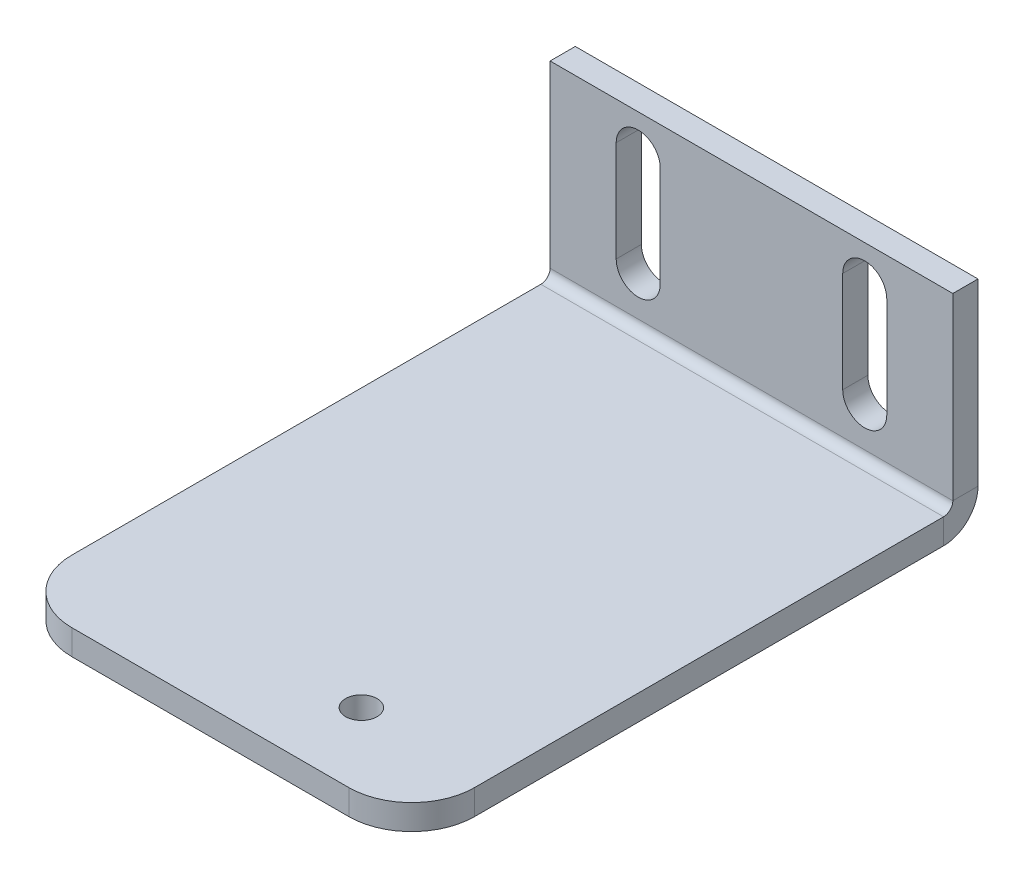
ISO-10303-21;
HEADER;
FILE_DESCRIPTION(('STEP AP214'),'2;1');
FILE_NAME('part.step','',(''),(''),'','','');
FILE_SCHEMA(('AUTOMOTIVE_DESIGN { 1 0 10303 214 1 1 1 1 }'));
ENDSEC;
DATA;
#1=APPLICATION_CONTEXT('core data for automotive mechanical design processes');
#2=APPLICATION_PROTOCOL_DEFINITION('international standard','automotive_design',2000,#1);
#3=PRODUCT_CONTEXT('',#1,'mechanical');
#4=PRODUCT('Part','Part','',(#3));
#5=PRODUCT_RELATED_PRODUCT_CATEGORY('part','',(#4));
#6=PRODUCT_DEFINITION_FORMATION('','',#4);
#7=PRODUCT_DEFINITION_CONTEXT('part definition',#1,'design');
#8=PRODUCT_DEFINITION('design','',#6,#7);
#9=PRODUCT_DEFINITION_SHAPE('','',#8);
#10=(LENGTH_UNIT() NAMED_UNIT(*) SI_UNIT(.MILLI.,.METRE.));
#11=(NAMED_UNIT(*) PLANE_ANGLE_UNIT() SI_UNIT($,.RADIAN.));
#12=(NAMED_UNIT(*) SI_UNIT($,.STERADIAN.) SOLID_ANGLE_UNIT());
#13=UNCERTAINTY_MEASURE_WITH_UNIT(LENGTH_MEASURE(1.E-05),#10,'distance_accuracy_value','');
#14=(GEOMETRIC_REPRESENTATION_CONTEXT(3) GLOBAL_UNCERTAINTY_ASSIGNED_CONTEXT((#13)) GLOBAL_UNIT_ASSIGNED_CONTEXT((#10,
#11,#12)) REPRESENTATION_CONTEXT('',''));
#15=CARTESIAN_POINT('',(0.,0.,0.));
#16=DIRECTION('',(0.,0.,1.));
#17=DIRECTION('',(1.,0.,0.));
#18=AXIS2_PLACEMENT_3D('',#15,#16,#17);
#19=CARTESIAN_POINT('',(444.015455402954,32.092185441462,-2.));
#20=DIRECTION('',(1.,0.,0.));
#21=DIRECTION('',(0.,0.,-1.));
#22=AXIS2_PLACEMENT_3D('',#19,#20,#21);
#23=PLANE('',#22);
#24=DIRECTION('',(0.,1.,0.));
#25=VECTOR('',#24,1.);
#26=CARTESIAN_POINT('',(444.015455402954,32.092185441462,0.));
#27=LINE('',#26,#25);
#28=CARTESIAN_POINT('',(444.015455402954,34.828785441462,0.));
#29=VERTEX_POINT('',#28);
#30=CARTESIAN_POINT('',(444.015455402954,49.092185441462,0.));
#31=VERTEX_POINT('',#30);
#32=EDGE_CURVE('E265',#29,#31,#27,.T.);
#33=ORIENTED_EDGE('',*,*,#32,.F.);
#34=DIRECTION('',(0.,0.,-1.));
#35=VECTOR('',#34,1.);
#36=CARTESIAN_POINT('',(444.015455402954,34.828785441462,0.));
#37=LINE('',#36,#35);
#38=CARTESIAN_POINT('',(444.015455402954,34.828785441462,-2.));
#39=VERTEX_POINT('',#38);
#40=EDGE_CURVE('E251',#29,#39,#37,.T.);
#41=ORIENTED_EDGE('',*,*,#40,.T.);
#42=DIRECTION('',(0.,1.,0.));
#43=VECTOR('',#42,1.);
#44=CARTESIAN_POINT('',(444.015455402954,32.092185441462,-2.));
#45=LINE('',#44,#43);
#46=CARTESIAN_POINT('',(444.015455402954,49.092185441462,-2.));
#47=VERTEX_POINT('',#46);
#48=EDGE_CURVE('E268',#39,#47,#45,.T.);
#49=ORIENTED_EDGE('',*,*,#48,.T.);
#50=DIRECTION('',(0.,0.,1.));
#51=VECTOR('',#50,1.);
#52=CARTESIAN_POINT('',(444.015455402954,49.092185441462,-2.));
#53=LINE('',#52,#51);
#54=EDGE_CURVE('E277',#47,#31,#53,.T.);
#55=ORIENTED_EDGE('',*,*,#54,.T.);
#56=EDGE_LOOP('',(#33,#41,#49,#55));
#57=FACE_BOUND('',#56,.T.);
#58=ADVANCED_FACE('F16',(#57),#23,.T.);
#59=CARTESIAN_POINT('',(0.,0.,-2.));
#60=DIRECTION('',(0.,0.,1.));
#61=DIRECTION('',(1.,0.,0.));
#62=AXIS2_PLACEMENT_3D('',#59,#60,#61);
#63=PLANE('',#62);
#64=DIRECTION('',(0.,1.,0.));
#65=VECTOR('',#64,1.);
#66=CARTESIAN_POINT('',(438.765455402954,46.092185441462,-2.));
#67=LINE('',#66,#65);
#68=CARTESIAN_POINT('',(438.765455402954,38.092185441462,-2.));
#69=VERTEX_POINT('',#68);
#70=CARTESIAN_POINT('',(438.765455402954,46.092185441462,-2.));
#71=VERTEX_POINT('',#70);
#72=EDGE_CURVE('E155',#69,#71,#67,.T.);
#73=ORIENTED_EDGE('',*,*,#72,.T.);
#74=CARTESIAN_POINT('',(437.015455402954,46.092185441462,-2.));
#75=DIRECTION('',(0.,0.,1.));
#76=DIRECTION('',(-1.,0.,0.));
#77=AXIS2_PLACEMENT_3D('',#74,#75,#76);
#78=CIRCLE('',#77,1.74999999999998);
#79=CARTESIAN_POINT('',(435.265455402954,46.092185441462,-2.));
#80=VERTEX_POINT('',#79);
#81=EDGE_CURVE('E147',#71,#80,#78,.T.);
#82=ORIENTED_EDGE('',*,*,#81,.T.);
#83=DIRECTION('',(0.,-1.,0.));
#84=VECTOR('',#83,1.);
#85=CARTESIAN_POINT('',(435.265455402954,46.092185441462,-2.));
#86=LINE('',#85,#84);
#87=CARTESIAN_POINT('',(435.265455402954,38.092185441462,-2.));
#88=VERTEX_POINT('',#87);
#89=EDGE_CURVE('E159',#80,#88,#86,.T.);
#90=ORIENTED_EDGE('',*,*,#89,.T.);
#91=CARTESIAN_POINT('',(437.015455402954,38.092185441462,-2.));
#92=DIRECTION('',(0.,0.,1.));
#93=DIRECTION('',(-1.,0.,0.));
#94=AXIS2_PLACEMENT_3D('',#91,#92,#93);
#95=CIRCLE('',#94,1.74999999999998);
#96=EDGE_CURVE('E163',#88,#69,#95,.T.);
#97=ORIENTED_EDGE('',*,*,#96,.T.);
#98=EDGE_LOOP('',(#73,#82,#90,#97));
#99=FACE_BOUND('',#98,.T.);
#100=DIRECTION('',(0.,1.,0.));
#101=VECTOR('',#100,1.);
#102=CARTESIAN_POINT('',(420.765455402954,46.092185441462,-2.));
#103=LINE('',#102,#101);
#104=CARTESIAN_POINT('',(420.765455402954,38.092185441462,-2.));
#105=VERTEX_POINT('',#104);
#106=CARTESIAN_POINT('',(420.765455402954,46.092185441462,-2.));
#107=VERTEX_POINT('',#106);
#108=EDGE_CURVE('E200',#105,#107,#103,.T.);
#109=ORIENTED_EDGE('',*,*,#108,.T.);
#110=CARTESIAN_POINT('',(419.015455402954,46.092185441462,-2.));
#111=DIRECTION('',(0.,0.,1.));
#112=DIRECTION('',(1.,0.,0.));
#113=AXIS2_PLACEMENT_3D('',#110,#111,#112);
#114=CIRCLE('',#113,1.74999999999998);
#115=CARTESIAN_POINT('',(417.265455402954,46.092185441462,-2.));
#116=VERTEX_POINT('',#115);
#117=EDGE_CURVE('E190',#107,#116,#114,.T.);
#118=ORIENTED_EDGE('',*,*,#117,.T.);
#119=DIRECTION('',(0.,-1.,0.));
#120=VECTOR('',#119,1.);
#121=CARTESIAN_POINT('',(417.265455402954,46.092185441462,-2.));
#122=LINE('',#121,#120);
#123=CARTESIAN_POINT('',(417.265455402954,38.092185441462,-2.));
#124=VERTEX_POINT('',#123);
#125=EDGE_CURVE('E193',#116,#124,#122,.T.);
#126=ORIENTED_EDGE('',*,*,#125,.T.);
#127=CARTESIAN_POINT('',(419.015455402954,38.092185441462,-2.));
#128=DIRECTION('',(0.,0.,1.));
#129=DIRECTION('',(1.,0.,0.));
#130=AXIS2_PLACEMENT_3D('',#127,#128,#129);
#131=CIRCLE('',#130,1.74999999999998);
#132=EDGE_CURVE('E197',#124,#105,#131,.T.);
#133=ORIENTED_EDGE('',*,*,#132,.T.);
#134=EDGE_LOOP('',(#109,#118,#126,#133));
#135=FACE_BOUND('',#134,.T.);
#136=DIRECTION('',(1.,0.,0.));
#137=VECTOR('',#136,1.);
#138=CARTESIAN_POINT('',(444.015455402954,34.828785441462,-2.));
#139=LINE('',#138,#137);
#140=CARTESIAN_POINT('',(412.015455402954,34.828785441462,-2.));
#141=VERTEX_POINT('',#140);
#142=EDGE_CURVE('E245',#39,#141,#139,.F.);
#143=ORIENTED_EDGE('',*,*,#142,.T.);
#144=DIRECTION('',(0.,-1.,0.));
#145=VECTOR('',#144,1.);
#146=CARTESIAN_POINT('',(412.015455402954,32.092185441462,-2.));
#147=LINE('',#146,#145);
#148=CARTESIAN_POINT('',(412.015455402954,49.092185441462,-2.));
#149=VERTEX_POINT('',#148);
#150=EDGE_CURVE('E274',#149,#141,#147,.T.);
#151=ORIENTED_EDGE('',*,*,#150,.F.);
#152=DIRECTION('',(-1.,0.,0.));
#153=VECTOR('',#152,1.);
#154=CARTESIAN_POINT('',(444.015455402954,49.092185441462,-2.));
#155=LINE('',#154,#153);
#156=EDGE_CURVE('E270',#47,#149,#155,.T.);
#157=ORIENTED_EDGE('',*,*,#156,.F.);
#158=ORIENTED_EDGE('',*,*,#48,.F.);
#159=EDGE_LOOP('',(#143,#151,#157,#158));
#160=FACE_BOUND('',#159,.T.);
#161=ADVANCED_FACE('F165',(#99,#135,#160),#63,.F.);
#162=CARTESIAN_POINT('',(0.,0.,0.));
#163=DIRECTION('',(0.,0.,1.));
#164=DIRECTION('',(1.,0.,0.));
#165=AXIS2_PLACEMENT_3D('',#162,#163,#164);
#166=PLANE('',#165);
#167=CARTESIAN_POINT('',(437.015455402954,46.092185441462,0.));
#168=DIRECTION('',(0.,0.,1.));
#169=DIRECTION('',(-1.,0.,0.));
#170=AXIS2_PLACEMENT_3D('',#167,#168,#169);
#171=CIRCLE('',#170,1.74999999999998);
#172=CARTESIAN_POINT('',(438.765455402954,46.092185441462,0.));
#173=VERTEX_POINT('',#172);
#174=CARTESIAN_POINT('',(435.265455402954,46.092185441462,0.));
#175=VERTEX_POINT('',#174);
#176=EDGE_CURVE('E150',#173,#175,#171,.T.);
#177=ORIENTED_EDGE('',*,*,#176,.F.);
#178=DIRECTION('',(0.,1.,0.));
#179=VECTOR('',#178,1.);
#180=CARTESIAN_POINT('',(438.765455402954,46.092185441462,0.));
#181=LINE('',#180,#179);
#182=CARTESIAN_POINT('',(438.765455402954,38.092185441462,0.));
#183=VERTEX_POINT('',#182);
#184=EDGE_CURVE('E168',#183,#173,#181,.T.);
#185=ORIENTED_EDGE('',*,*,#184,.F.);
#186=CARTESIAN_POINT('',(437.015455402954,38.092185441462,0.));
#187=DIRECTION('',(0.,0.,1.));
#188=DIRECTION('',(-1.,0.,0.));
#189=AXIS2_PLACEMENT_3D('',#186,#187,#188);
#190=CIRCLE('',#189,1.74999999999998);
#191=CARTESIAN_POINT('',(435.265455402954,38.092185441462,0.));
#192=VERTEX_POINT('',#191);
#193=EDGE_CURVE('E171',#192,#183,#190,.T.);
#194=ORIENTED_EDGE('',*,*,#193,.F.);
#195=DIRECTION('',(0.,-1.,0.));
#196=VECTOR('',#195,1.);
#197=CARTESIAN_POINT('',(435.265455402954,46.092185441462,0.));
#198=LINE('',#197,#196);
#199=EDGE_CURVE('E180',#175,#192,#198,.T.);
#200=ORIENTED_EDGE('',*,*,#199,.F.);
#201=EDGE_LOOP('',(#177,#185,#194,#200));
#202=FACE_BOUND('',#201,.T.);
#203=CARTESIAN_POINT('',(419.015455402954,46.092185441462,0.));
#204=DIRECTION('',(0.,0.,1.));
#205=DIRECTION('',(1.,0.,0.));
#206=AXIS2_PLACEMENT_3D('',#203,#204,#205);
#207=CIRCLE('',#206,1.74999999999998);
#208=CARTESIAN_POINT('',(420.765455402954,46.092185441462,0.));
#209=VERTEX_POINT('',#208);
#210=CARTESIAN_POINT('',(417.265455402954,46.092185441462,0.));
#211=VERTEX_POINT('',#210);
#212=EDGE_CURVE('E186',#209,#211,#207,.T.);
#213=ORIENTED_EDGE('',*,*,#212,.F.);
#214=DIRECTION('',(0.,1.,0.));
#215=VECTOR('',#214,1.);
#216=CARTESIAN_POINT('',(420.765455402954,46.092185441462,0.));
#217=LINE('',#216,#215);
#218=CARTESIAN_POINT('',(420.765455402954,38.092185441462,0.));
#219=VERTEX_POINT('',#218);
#220=EDGE_CURVE('E194',#219,#209,#217,.T.);
#221=ORIENTED_EDGE('',*,*,#220,.F.);
#222=CARTESIAN_POINT('',(419.015455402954,38.092185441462,0.));
#223=DIRECTION('',(0.,0.,1.));
#224=DIRECTION('',(1.,0.,0.));
#225=AXIS2_PLACEMENT_3D('',#222,#223,#224);
#226=CIRCLE('',#225,1.74999999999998);
#227=CARTESIAN_POINT('',(417.265455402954,38.092185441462,0.));
#228=VERTEX_POINT('',#227);
#229=EDGE_CURVE('E208',#228,#219,#226,.T.);
#230=ORIENTED_EDGE('',*,*,#229,.F.);
#231=DIRECTION('',(0.,-1.,0.));
#232=VECTOR('',#231,1.);
#233=CARTESIAN_POINT('',(417.265455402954,46.092185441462,0.));
#234=LINE('',#233,#232);
#235=EDGE_CURVE('E205',#211,#228,#234,.T.);
#236=ORIENTED_EDGE('',*,*,#235,.F.);
#237=EDGE_LOOP('',(#213,#221,#230,#236));
#238=FACE_BOUND('',#237,.T.);
#239=DIRECTION('',(0.,-1.,0.));
#240=VECTOR('',#239,1.);
#241=CARTESIAN_POINT('',(412.015455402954,32.092185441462,0.));
#242=LINE('',#241,#240);
#243=CARTESIAN_POINT('',(412.015455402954,49.092185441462,0.));
#244=VERTEX_POINT('',#243);
#245=CARTESIAN_POINT('',(412.015455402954,34.828785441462,0.));
#246=VERTEX_POINT('',#245);
#247=EDGE_CURVE('E271',#244,#246,#242,.T.);
#248=ORIENTED_EDGE('',*,*,#247,.T.);
#249=DIRECTION('',(1.,0.,0.));
#250=VECTOR('',#249,1.);
#251=CARTESIAN_POINT('',(444.015455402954,34.828785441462,0.));
#252=LINE('',#251,#250);
#253=EDGE_CURVE('E257',#29,#246,#252,.F.);
#254=ORIENTED_EDGE('',*,*,#253,.F.);
#255=ORIENTED_EDGE('',*,*,#32,.T.);
#256=DIRECTION('',(-1.,0.,0.));
#257=VECTOR('',#256,1.);
#258=CARTESIAN_POINT('',(444.015455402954,49.092185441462,0.));
#259=LINE('',#258,#257);
#260=EDGE_CURVE('E279',#31,#244,#259,.T.);
#261=ORIENTED_EDGE('',*,*,#260,.T.);
#262=EDGE_LOOP('',(#248,#254,#255,#261));
#263=FACE_BOUND('',#262,.T.);
#264=ADVANCED_FACE('F339',(#202,#238,#263),#166,.T.);
#265=CARTESIAN_POINT('',(412.015455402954,32.092185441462,-2.));
#266=DIRECTION('',(-1.,0.,0.));
#267=DIRECTION('',(0.,0.,1.));
#268=AXIS2_PLACEMENT_3D('',#265,#266,#267);
#269=PLANE('',#268);
#270=DIRECTION('',(0.,0.,-1.));
#271=VECTOR('',#270,1.);
#272=CARTESIAN_POINT('',(412.015455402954,34.828785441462,0.));
#273=LINE('',#272,#271);
#274=EDGE_CURVE('E262',#246,#141,#273,.T.);
#275=ORIENTED_EDGE('',*,*,#274,.F.);
#276=ORIENTED_EDGE('',*,*,#247,.F.);
#277=DIRECTION('',(0.,0.,1.));
#278=VECTOR('',#277,1.);
#279=CARTESIAN_POINT('',(412.015455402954,49.092185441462,-2.));
#280=LINE('',#279,#278);
#281=EDGE_CURVE('E284',#149,#244,#280,.T.);
#282=ORIENTED_EDGE('',*,*,#281,.F.);
#283=ORIENTED_EDGE('',*,*,#150,.T.);
#284=EDGE_LOOP('',(#275,#276,#282,#283));
#285=FACE_BOUND('',#284,.T.);
#286=ADVANCED_FACE('F336',(#285),#269,.T.);
#287=CARTESIAN_POINT('',(444.015455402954,49.092185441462,-2.));
#288=DIRECTION('',(0.,1.,0.));
#289=DIRECTION('',(0.,0.,1.));
#290=AXIS2_PLACEMENT_3D('',#287,#288,#289);
#291=PLANE('',#290);
#292=ORIENTED_EDGE('',*,*,#260,.F.);
#293=ORIENTED_EDGE('',*,*,#54,.F.);
#294=ORIENTED_EDGE('',*,*,#156,.T.);
#295=ORIENTED_EDGE('',*,*,#281,.T.);
#296=EDGE_LOOP('',(#292,#293,#294,#295));
#297=FACE_BOUND('',#296,.T.);
#298=ADVANCED_FACE('F364',(#297),#291,.T.);
#299=CARTESIAN_POINT('',(412.015455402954,34.828785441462,0.7366));
#300=DIRECTION('',(-1.,0.,0.));
#301=DIRECTION('',(0.,0.,1.));
#302=AXIS2_PLACEMENT_3D('',#299,#300,#301);
#303=PLANE('',#302);
#304=DIRECTION('',(0.,1.,0.));
#305=VECTOR('',#304,1.);
#306=CARTESIAN_POINT('',(412.015455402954,32.092185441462,0.73659999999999));
#307=LINE('',#306,#305);
#308=CARTESIAN_POINT('',(412.015455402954,34.092185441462,0.7366));
#309=VERTEX_POINT('',#308);
#310=CARTESIAN_POINT('',(412.015455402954,32.092185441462,0.73659999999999));
#311=VERTEX_POINT('',#310);
#312=EDGE_CURVE('E215',#309,#311,#307,.F.);
#313=ORIENTED_EDGE('',*,*,#312,.F.);
#314=CARTESIAN_POINT('',(412.015455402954,34.828785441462,0.7366));
#315=DIRECTION('',(1.,0.,0.));
#316=DIRECTION('',(0.,0.,-1.));
#317=AXIS2_PLACEMENT_3D('',#314,#315,#316);
#318=CIRCLE('',#317,0.7366);
#319=EDGE_CURVE('E254',#246,#309,#318,.F.);
#320=ORIENTED_EDGE('',*,*,#319,.F.);
#321=ORIENTED_EDGE('',*,*,#274,.T.);
#322=CARTESIAN_POINT('',(412.015455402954,34.828785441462,0.7366));
#323=DIRECTION('',(1.,0.,0.));
#324=DIRECTION('',(0.,0.,-1.));
#325=AXIS2_PLACEMENT_3D('',#322,#323,#324);
#326=CIRCLE('',#325,2.7366);
#327=EDGE_CURVE('E247',#141,#311,#326,.F.);
#328=ORIENTED_EDGE('',*,*,#327,.T.);
#329=EDGE_LOOP('',(#313,#320,#321,#328));
#330=FACE_BOUND('',#329,.T.);
#331=ADVANCED_FACE('F332',(#330),#303,.T.);
#332=CARTESIAN_POINT('',(444.015455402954,34.828785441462,0.7366));
#333=DIRECTION('',(-1.,0.,0.));
#334=DIRECTION('',(0.,0.,1.));
#335=AXIS2_PLACEMENT_3D('',#332,#333,#334);
#336=PLANE('',#335);
#337=CARTESIAN_POINT('',(444.015455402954,34.828785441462,0.7366));
#338=DIRECTION('',(1.,0.,0.));
#339=DIRECTION('',(0.,0.,-1.));
#340=AXIS2_PLACEMENT_3D('',#337,#338,#339);
#341=CIRCLE('',#340,0.7366);
#342=CARTESIAN_POINT('',(444.015455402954,34.092185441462,0.7366));
#343=VERTEX_POINT('',#342);
#344=EDGE_CURVE('E224',#343,#29,#341,.T.);
#345=ORIENTED_EDGE('',*,*,#344,.F.);
#346=DIRECTION('',(0.,1.,0.));
#347=VECTOR('',#346,1.);
#348=CARTESIAN_POINT('',(444.015455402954,34.092185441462,0.7366));
#349=LINE('',#348,#347);
#350=CARTESIAN_POINT('',(444.015455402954,32.092185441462,0.73659999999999));
#351=VERTEX_POINT('',#350);
#352=EDGE_CURVE('E238',#343,#351,#349,.F.);
#353=ORIENTED_EDGE('',*,*,#352,.T.);
#354=CARTESIAN_POINT('',(444.015455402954,34.828785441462,0.7366));
#355=DIRECTION('',(1.,0.,0.));
#356=DIRECTION('',(0.,0.,-1.));
#357=AXIS2_PLACEMENT_3D('',#354,#355,#356);
#358=CIRCLE('',#357,2.7366);
#359=EDGE_CURVE('E248',#351,#39,#358,.T.);
#360=ORIENTED_EDGE('',*,*,#359,.T.);
#361=ORIENTED_EDGE('',*,*,#40,.F.);
#362=EDGE_LOOP('',(#345,#353,#360,#361));
#363=FACE_BOUND('',#362,.T.);
#364=ADVANCED_FACE('F325',(#363),#336,.F.);
#365=CARTESIAN_POINT('',(444.015455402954,34.828785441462,0.7366));
#366=DIRECTION('',(1.,0.,0.));
#367=DIRECTION('',(0.,-1.,0.));
#368=AXIS2_PLACEMENT_3D('',#365,#366,#367);
#369=CYLINDRICAL_SURFACE('',#368,2.7366);
#370=ORIENTED_EDGE('',*,*,#142,.F.);
#371=ORIENTED_EDGE('',*,*,#359,.F.);
#372=DIRECTION('',(1.,0.,0.));
#373=VECTOR('',#372,1.);
#374=CARTESIAN_POINT('',(412.015455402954,32.092185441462,0.73659999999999));
#375=LINE('',#374,#373);
#376=EDGE_CURVE('E235',#351,#311,#375,.F.);
#377=ORIENTED_EDGE('',*,*,#376,.T.);
#378=ORIENTED_EDGE('',*,*,#327,.F.);
#379=EDGE_LOOP('',(#370,#371,#377,#378));
#380=FACE_BOUND('',#379,.T.);
#381=ADVANCED_FACE('F330',(#380),#369,.T.);
#382=CARTESIAN_POINT('',(444.015455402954,34.828785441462,0.7366));
#383=DIRECTION('',(1.,0.,0.));
#384=DIRECTION('',(0.,-1.,0.));
#385=AXIS2_PLACEMENT_3D('',#382,#383,#384);
#386=CYLINDRICAL_SURFACE('',#385,0.7366);
#387=ORIENTED_EDGE('',*,*,#253,.T.);
#388=ORIENTED_EDGE('',*,*,#319,.T.);
#389=DIRECTION('',(1.,0.,0.));
#390=VECTOR('',#389,1.);
#391=CARTESIAN_POINT('',(412.015455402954,34.092185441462,0.7366));
#392=LINE('',#391,#390);
#393=EDGE_CURVE('E241',#309,#343,#392,.T.);
#394=ORIENTED_EDGE('',*,*,#393,.T.);
#395=ORIENTED_EDGE('',*,*,#344,.T.);
#396=EDGE_LOOP('',(#387,#388,#394,#395));
#397=FACE_BOUND('',#396,.T.);
#398=ADVANCED_FACE('F343',(#397),#386,.F.);
#399=CARTESIAN_POINT('',(412.015455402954,32.092185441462,0.));
#400=DIRECTION('',(1.,0.,0.));
#401=DIRECTION('',(0.,1.,0.));
#402=AXIS2_PLACEMENT_3D('',#399,#400,#401);
#403=PLANE('',#402);
#404=DIRECTION('',(0.,0.,-1.));
#405=VECTOR('',#404,1.);
#406=CARTESIAN_POINT('',(412.015455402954,32.092185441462,1.06948524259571E-13));
#407=LINE('',#406,#405);
#408=CARTESIAN_POINT('',(412.015455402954,32.0921854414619,38.));
#409=VERTEX_POINT('',#408);
#410=EDGE_CURVE('E227',#409,#311,#407,.T.);
#411=ORIENTED_EDGE('',*,*,#410,.F.);
#412=DIRECTION('',(0.,1.,0.));
#413=VECTOR('',#412,1.);
#414=CARTESIAN_POINT('',(412.015455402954,32.0921854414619,38.));
#415=LINE('',#414,#413);
#416=CARTESIAN_POINT('',(412.015455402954,34.0921854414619,38.));
#417=VERTEX_POINT('',#416);
#418=EDGE_CURVE('E286',#409,#417,#415,.T.);
#419=ORIENTED_EDGE('',*,*,#418,.T.);
#420=DIRECTION('',(0.,0.,1.));
#421=VECTOR('',#420,1.);
#422=CARTESIAN_POINT('',(412.015455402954,34.092185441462,0.));
#423=LINE('',#422,#421);
#424=EDGE_CURVE('E233',#417,#309,#423,.F.);
#425=ORIENTED_EDGE('',*,*,#424,.T.);
#426=ORIENTED_EDGE('',*,*,#312,.T.);
#427=EDGE_LOOP('',(#411,#419,#425,#426));
#428=FACE_BOUND('',#427,.T.);
#429=ADVANCED_FACE('F308',(#428),#403,.F.);
#430=CARTESIAN_POINT('',(444.015455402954,32.0921854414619,43.));
#431=DIRECTION('',(-1.,0.,0.));
#432=DIRECTION('',(0.,-1.,0.));
#433=AXIS2_PLACEMENT_3D('',#430,#431,#432);
#434=PLANE('',#433);
#435=DIRECTION('',(0.,0.,-1.));
#436=VECTOR('',#435,1.);
#437=CARTESIAN_POINT('',(444.015455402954,34.0921854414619,43.));
#438=LINE('',#437,#436);
#439=CARTESIAN_POINT('',(444.015455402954,34.0921854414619,38.));
#440=VERTEX_POINT('',#439);
#441=EDGE_CURVE('E231',#343,#440,#438,.F.);
#442=ORIENTED_EDGE('',*,*,#441,.T.);
#443=DIRECTION('',(0.,1.,0.));
#444=VECTOR('',#443,1.);
#445=CARTESIAN_POINT('',(444.015455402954,32.0921854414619,38.));
#446=LINE('',#445,#444);
#447=CARTESIAN_POINT('',(444.015455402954,32.0921854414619,38.));
#448=VERTEX_POINT('',#447);
#449=EDGE_CURVE('E11',#440,#448,#446,.F.);
#450=ORIENTED_EDGE('',*,*,#449,.T.);
#451=DIRECTION('',(0.,0.,1.));
#452=VECTOR('',#451,1.);
#453=CARTESIAN_POINT('',(444.015455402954,32.092185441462,1.06948524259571E-13));
#454=LINE('',#453,#452);
#455=EDGE_CURVE('E225',#351,#448,#454,.T.);
#456=ORIENTED_EDGE('',*,*,#455,.F.);
#457=ORIENTED_EDGE('',*,*,#352,.F.);
#458=EDGE_LOOP('',(#442,#450,#456,#457));
#459=FACE_BOUND('',#458,.T.);
#460=ADVANCED_FACE('F322',(#459),#434,.F.);
#461=CARTESIAN_POINT('',(0.,32.092185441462,1.06948524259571E-13));
#462=DIRECTION('',(0.,1.,0.));
#463=DIRECTION('',(0.,0.,1.));
#464=AXIS2_PLACEMENT_3D('',#461,#462,#463);
#465=PLANE('',#464);
#466=CARTESIAN_POINT('',(434.015455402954,32.0921854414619,37.));
#467=DIRECTION('',(0.,-1.,0.));
#468=DIRECTION('',(0.,0.,-1.));
#469=AXIS2_PLACEMENT_3D('',#466,#467,#468);
#470=CIRCLE('',#469,1.24999999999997);
#471=CARTESIAN_POINT('',(434.015455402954,32.0921854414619,35.75));
#472=VERTEX_POINT('',#471);
#473=EDGE_CURVE('E589',#472,#472,#470,.T.);
#474=ORIENTED_EDGE('',*,*,#473,.F.);
#475=EDGE_LOOP('',(#474));
#476=FACE_BOUND('',#475,.T.);
#477=DIRECTION('',(-1.,0.,0.));
#478=VECTOR('',#477,1.);
#479=CARTESIAN_POINT('',(0.,32.0921854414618,43.));
#480=LINE('',#479,#478);
#481=CARTESIAN_POINT('',(439.015455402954,32.0921854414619,43.));
#482=VERTEX_POINT('',#481);
#483=CARTESIAN_POINT('',(417.015455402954,32.0921854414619,43.));
#484=VERTEX_POINT('',#483);
#485=EDGE_CURVE('E222',#482,#484,#480,.T.);
#486=ORIENTED_EDGE('',*,*,#485,.T.);
#487=CARTESIAN_POINT('',(417.015455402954,32.0921854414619,38.));
#488=DIRECTION('',(0.,1.,0.));
#489=DIRECTION('',(0.,0.,1.));
#490=AXIS2_PLACEMENT_3D('',#487,#488,#489);
#491=CIRCLE('',#490,5.);
#492=EDGE_CURVE('E24',#484,#409,#491,.F.);
#493=ORIENTED_EDGE('',*,*,#492,.T.);
#494=ORIENTED_EDGE('',*,*,#410,.T.);
#495=ORIENTED_EDGE('',*,*,#376,.F.);
#496=ORIENTED_EDGE('',*,*,#455,.T.);
#497=CARTESIAN_POINT('',(439.015455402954,32.0921854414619,38.));
#498=DIRECTION('',(0.,1.,0.));
#499=DIRECTION('',(0.,0.,1.));
#500=AXIS2_PLACEMENT_3D('',#497,#498,#499);
#501=CIRCLE('',#500,5.);
#502=EDGE_CURVE('E299',#448,#482,#501,.F.);
#503=ORIENTED_EDGE('',*,*,#502,.T.);
#504=EDGE_LOOP('',(#486,#493,#494,#495,#496,#503));
#505=FACE_BOUND('',#504,.T.);
#506=ADVANCED_FACE('F303',(#476,#505),#465,.F.);
#507=CARTESIAN_POINT('',(0.,34.092185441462,1.13931486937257E-13));
#508=DIRECTION('',(0.,1.,0.));
#509=DIRECTION('',(0.,0.,1.));
#510=AXIS2_PLACEMENT_3D('',#507,#508,#509);
#511=PLANE('',#510);
#512=CARTESIAN_POINT('',(434.015455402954,34.0921854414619,37.));
#513=DIRECTION('',(0.,1.,0.));
#514=DIRECTION('',(0.,0.,1.));
#515=AXIS2_PLACEMENT_3D('',#512,#513,#514);
#516=CIRCLE('',#515,1.24999999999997);
#517=CARTESIAN_POINT('',(434.015455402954,34.0921854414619,38.25));
#518=VERTEX_POINT('',#517);
#519=EDGE_CURVE('E174',#518,#518,#516,.T.);
#520=ORIENTED_EDGE('',*,*,#519,.F.);
#521=EDGE_LOOP('',(#520));
#522=FACE_BOUND('',#521,.T.);
#523=ORIENTED_EDGE('',*,*,#424,.F.);
#524=CARTESIAN_POINT('',(417.015455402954,34.0921854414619,38.));
#525=DIRECTION('',(0.,1.,0.));
#526=DIRECTION('',(0.,0.,1.));
#527=AXIS2_PLACEMENT_3D('',#524,#525,#526);
#528=CIRCLE('',#527,5.);
#529=CARTESIAN_POINT('',(417.015455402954,34.0921854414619,43.));
#530=VERTEX_POINT('',#529);
#531=EDGE_CURVE('E293',#417,#530,#528,.T.);
#532=ORIENTED_EDGE('',*,*,#531,.T.);
#533=DIRECTION('',(1.,0.,0.));
#534=VECTOR('',#533,1.);
#535=CARTESIAN_POINT('',(412.015455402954,34.0921854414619,43.));
#536=LINE('',#535,#534);
#537=CARTESIAN_POINT('',(439.015455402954,34.0921854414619,43.));
#538=VERTEX_POINT('',#537);
#539=EDGE_CURVE('E229',#538,#530,#536,.F.);
#540=ORIENTED_EDGE('',*,*,#539,.F.);
#541=CARTESIAN_POINT('',(439.015455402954,34.0921854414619,38.));
#542=DIRECTION('',(0.,1.,0.));
#543=DIRECTION('',(0.,0.,1.));
#544=AXIS2_PLACEMENT_3D('',#541,#542,#543);
#545=CIRCLE('',#544,5.);
#546=EDGE_CURVE('E291',#538,#440,#545,.T.);
#547=ORIENTED_EDGE('',*,*,#546,.T.);
#548=ORIENTED_EDGE('',*,*,#441,.F.);
#549=ORIENTED_EDGE('',*,*,#393,.F.);
#550=EDGE_LOOP('',(#523,#532,#540,#547,#548,#549));
#551=FACE_BOUND('',#550,.T.);
#552=ADVANCED_FACE('F314',(#522,#551),#511,.T.);
#553=CARTESIAN_POINT('',(412.015455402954,32.0921854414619,43.));
#554=DIRECTION('',(0.,0.,-1.));
#555=DIRECTION('',(0.,1.,0.));
#556=AXIS2_PLACEMENT_3D('',#553,#554,#555);
#557=PLANE('',#556);
#558=ORIENTED_EDGE('',*,*,#539,.T.);
#559=DIRECTION('',(0.,1.,0.));
#560=VECTOR('',#559,1.);
#561=CARTESIAN_POINT('',(417.015455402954,32.0921854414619,43.));
#562=LINE('',#561,#560);
#563=EDGE_CURVE('E37',#530,#484,#562,.F.);
#564=ORIENTED_EDGE('',*,*,#563,.T.);
#565=ORIENTED_EDGE('',*,*,#485,.F.);
#566=DIRECTION('',(0.,1.,0.));
#567=VECTOR('',#566,1.);
#568=CARTESIAN_POINT('',(439.015455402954,32.0921854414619,43.));
#569=LINE('',#568,#567);
#570=EDGE_CURVE('E295',#482,#538,#569,.T.);
#571=ORIENTED_EDGE('',*,*,#570,.T.);
#572=EDGE_LOOP('',(#558,#564,#565,#571));
#573=FACE_BOUND('',#572,.T.);
#574=ADVANCED_FACE('F316',(#573),#557,.F.);
#575=CARTESIAN_POINT('',(419.015455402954,46.092185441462,-2.));
#576=DIRECTION('',(0.,0.,1.));
#577=DIRECTION('',(1.,0.,0.));
#578=AXIS2_PLACEMENT_3D('',#575,#576,#577);
#579=CYLINDRICAL_SURFACE('',#578,1.74999999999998);
#580=ORIENTED_EDGE('',*,*,#212,.T.);
#581=DIRECTION('',(0.,0.,1.));
#582=VECTOR('',#581,1.);
#583=CARTESIAN_POINT('',(417.265455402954,46.092185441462,-2.));
#584=LINE('',#583,#582);
#585=EDGE_CURVE('E203',#116,#211,#584,.T.);
#586=ORIENTED_EDGE('',*,*,#585,.F.);
#587=ORIENTED_EDGE('',*,*,#117,.F.);
#588=DIRECTION('',(0.,0.,1.));
#589=VECTOR('',#588,1.);
#590=CARTESIAN_POINT('',(420.765455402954,46.092185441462,-2.));
#591=LINE('',#590,#589);
#592=EDGE_CURVE('E213',#107,#209,#591,.T.);
#593=ORIENTED_EDGE('',*,*,#592,.T.);
#594=EDGE_LOOP('',(#580,#586,#587,#593));
#595=FACE_BOUND('',#594,.T.);
#596=ADVANCED_FACE('F391',(#595),#579,.F.);
#597=CARTESIAN_POINT('',(420.765455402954,46.092185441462,-2.));
#598=DIRECTION('',(1.,0.,0.));
#599=DIRECTION('',(0.,0.,-1.));
#600=AXIS2_PLACEMENT_3D('',#597,#598,#599);
#601=PLANE('',#600);
#602=ORIENTED_EDGE('',*,*,#220,.T.);
#603=ORIENTED_EDGE('',*,*,#592,.F.);
#604=ORIENTED_EDGE('',*,*,#108,.F.);
#605=DIRECTION('',(0.,0.,1.));
#606=VECTOR('',#605,1.);
#607=CARTESIAN_POINT('',(420.765455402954,38.092185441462,-2.));
#608=LINE('',#607,#606);
#609=EDGE_CURVE('E216',#105,#219,#608,.T.);
#610=ORIENTED_EDGE('',*,*,#609,.T.);
#611=EDGE_LOOP('',(#602,#603,#604,#610));
#612=FACE_BOUND('',#611,.T.);
#613=ADVANCED_FACE('F387',(#612),#601,.F.);
#614=CARTESIAN_POINT('',(419.015455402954,38.092185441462,-2.));
#615=DIRECTION('',(0.,0.,1.));
#616=DIRECTION('',(1.,0.,0.));
#617=AXIS2_PLACEMENT_3D('',#614,#615,#616);
#618=CYLINDRICAL_SURFACE('',#617,1.74999999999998);
#619=ORIENTED_EDGE('',*,*,#229,.T.);
#620=ORIENTED_EDGE('',*,*,#609,.F.);
#621=ORIENTED_EDGE('',*,*,#132,.F.);
#622=DIRECTION('',(0.,0.,1.));
#623=VECTOR('',#622,1.);
#624=CARTESIAN_POINT('',(417.265455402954,38.092185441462,-2.));
#625=LINE('',#624,#623);
#626=EDGE_CURVE('E218',#124,#228,#625,.T.);
#627=ORIENTED_EDGE('',*,*,#626,.T.);
#628=EDGE_LOOP('',(#619,#620,#621,#627));
#629=FACE_BOUND('',#628,.T.);
#630=ADVANCED_FACE('F390',(#629),#618,.F.);
#631=CARTESIAN_POINT('',(417.265455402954,46.092185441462,-2.));
#632=DIRECTION('',(-1.,0.,0.));
#633=DIRECTION('',(0.,0.,1.));
#634=AXIS2_PLACEMENT_3D('',#631,#632,#633);
#635=PLANE('',#634);
#636=ORIENTED_EDGE('',*,*,#235,.T.);
#637=ORIENTED_EDGE('',*,*,#626,.F.);
#638=ORIENTED_EDGE('',*,*,#125,.F.);
#639=ORIENTED_EDGE('',*,*,#585,.T.);
#640=EDGE_LOOP('',(#636,#637,#638,#639));
#641=FACE_BOUND('',#640,.T.);
#642=ADVANCED_FACE('F386',(#641),#635,.F.);
#643=CARTESIAN_POINT('',(437.015455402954,46.092185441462,-2.));
#644=DIRECTION('',(0.,0.,1.));
#645=DIRECTION('',(1.,0.,0.));
#646=AXIS2_PLACEMENT_3D('',#643,#644,#645);
#647=CYLINDRICAL_SURFACE('',#646,1.74999999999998);
#648=ORIENTED_EDGE('',*,*,#176,.T.);
#649=DIRECTION('',(0.,0.,1.));
#650=VECTOR('',#649,1.);
#651=CARTESIAN_POINT('',(435.265455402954,46.092185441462,-2.));
#652=LINE('',#651,#650);
#653=EDGE_CURVE('E143',#80,#175,#652,.T.);
#654=ORIENTED_EDGE('',*,*,#653,.F.);
#655=ORIENTED_EDGE('',*,*,#81,.F.);
#656=DIRECTION('',(0.,0.,1.));
#657=VECTOR('',#656,1.);
#658=CARTESIAN_POINT('',(438.765455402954,46.092185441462,-2.));
#659=LINE('',#658,#657);
#660=EDGE_CURVE('E184',#71,#173,#659,.T.);
#661=ORIENTED_EDGE('',*,*,#660,.T.);
#662=EDGE_LOOP('',(#648,#654,#655,#661));
#663=FACE_BOUND('',#662,.T.);
#664=ADVANCED_FACE('F145',(#663),#647,.F.);
#665=CARTESIAN_POINT('',(438.765455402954,46.092185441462,-2.));
#666=DIRECTION('',(1.,0.,0.));
#667=DIRECTION('',(0.,0.,-1.));
#668=AXIS2_PLACEMENT_3D('',#665,#666,#667);
#669=PLANE('',#668);
#670=ORIENTED_EDGE('',*,*,#184,.T.);
#671=ORIENTED_EDGE('',*,*,#660,.F.);
#672=ORIENTED_EDGE('',*,*,#72,.F.);
#673=DIRECTION('',(0.,0.,1.));
#674=VECTOR('',#673,1.);
#675=CARTESIAN_POINT('',(438.765455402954,38.092185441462,-2.));
#676=LINE('',#675,#674);
#677=EDGE_CURVE('E187',#69,#183,#676,.T.);
#678=ORIENTED_EDGE('',*,*,#677,.T.);
#679=EDGE_LOOP('',(#670,#671,#672,#678));
#680=FACE_BOUND('',#679,.T.);
#681=ADVANCED_FACE('F379',(#680),#669,.F.);
#682=CARTESIAN_POINT('',(437.015455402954,38.092185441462,-2.));
#683=DIRECTION('',(0.,0.,1.));
#684=DIRECTION('',(1.,0.,0.));
#685=AXIS2_PLACEMENT_3D('',#682,#683,#684);
#686=CYLINDRICAL_SURFACE('',#685,1.74999999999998);
#687=ORIENTED_EDGE('',*,*,#193,.T.);
#688=ORIENTED_EDGE('',*,*,#677,.F.);
#689=ORIENTED_EDGE('',*,*,#96,.F.);
#690=DIRECTION('',(0.,0.,1.));
#691=VECTOR('',#690,1.);
#692=CARTESIAN_POINT('',(435.265455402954,38.092185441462,-2.));
#693=LINE('',#692,#691);
#694=EDGE_CURVE('E154',#88,#192,#693,.T.);
#695=ORIENTED_EDGE('',*,*,#694,.T.);
#696=EDGE_LOOP('',(#687,#688,#689,#695));
#697=FACE_BOUND('',#696,.T.);
#698=ADVANCED_FACE('F373',(#697),#686,.F.);
#699=CARTESIAN_POINT('',(435.265455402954,46.092185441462,-2.));
#700=DIRECTION('',(-1.,0.,0.));
#701=DIRECTION('',(0.,0.,1.));
#702=AXIS2_PLACEMENT_3D('',#699,#700,#701);
#703=PLANE('',#702);
#704=ORIENTED_EDGE('',*,*,#199,.T.);
#705=ORIENTED_EDGE('',*,*,#694,.F.);
#706=ORIENTED_EDGE('',*,*,#89,.F.);
#707=ORIENTED_EDGE('',*,*,#653,.T.);
#708=EDGE_LOOP('',(#704,#705,#706,#707));
#709=FACE_BOUND('',#708,.T.);
#710=ADVANCED_FACE('F160',(#709),#703,.F.);
#711=CARTESIAN_POINT('',(417.015455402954,32.0921854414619,38.));
#712=DIRECTION('',(0.,1.,0.));
#713=DIRECTION('',(0.,0.,1.));
#714=AXIS2_PLACEMENT_3D('',#711,#712,#713);
#715=CYLINDRICAL_SURFACE('',#714,5.);
#716=ORIENTED_EDGE('',*,*,#492,.F.);
#717=ORIENTED_EDGE('',*,*,#563,.F.);
#718=ORIENTED_EDGE('',*,*,#531,.F.);
#719=ORIENTED_EDGE('',*,*,#418,.F.);
#720=EDGE_LOOP('',(#716,#717,#718,#719));
#721=FACE_BOUND('',#720,.T.);
#722=ADVANCED_FACE('F311',(#721),#715,.T.);
#723=CARTESIAN_POINT('',(439.015455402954,32.0921854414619,38.));
#724=DIRECTION('',(0.,1.,0.));
#725=DIRECTION('',(0.,0.,1.));
#726=AXIS2_PLACEMENT_3D('',#723,#724,#725);
#727=CYLINDRICAL_SURFACE('',#726,5.);
#728=ORIENTED_EDGE('',*,*,#502,.F.);
#729=ORIENTED_EDGE('',*,*,#449,.F.);
#730=ORIENTED_EDGE('',*,*,#546,.F.);
#731=ORIENTED_EDGE('',*,*,#570,.F.);
#732=EDGE_LOOP('',(#728,#729,#730,#731));
#733=FACE_BOUND('',#732,.T.);
#734=ADVANCED_FACE('F18',(#733),#727,.T.);
#735=CARTESIAN_POINT('',(434.015455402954,32.0921854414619,37.));
#736=DIRECTION('',(0.,-1.,0.));
#737=DIRECTION('',(0.,0.,-1.));
#738=AXIS2_PLACEMENT_3D('',#735,#736,#737);
#739=CYLINDRICAL_SURFACE('',#738,1.24999999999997);
#740=ORIENTED_EDGE('',*,*,#519,.T.);
#741=EDGE_LOOP('',(#740));
#742=FACE_BOUND('',#741,.T.);
#743=ORIENTED_EDGE('',*,*,#473,.T.);
#744=EDGE_LOOP('',(#743));
#745=FACE_BOUND('',#744,.T.);
#746=ADVANCED_FACE('F372',(#742,#745),#739,.F.);
#747=CLOSED_SHELL('',(#58,#161,#264,#286,#298,#331,#364,#381,#398,#429,#460,#506,#552,#574,#596,
#613,#630,#642,#664,#681,#698,#710,#722,#734,#746));
#748=MANIFOLD_SOLID_BREP('B1',#747);
#749=ADVANCED_BREP_SHAPE_REPRESENTATION('',(#18,#748),#14);
#750=SHAPE_DEFINITION_REPRESENTATION(#9,#749);
ENDSEC;
END-ISO-10303-21;
